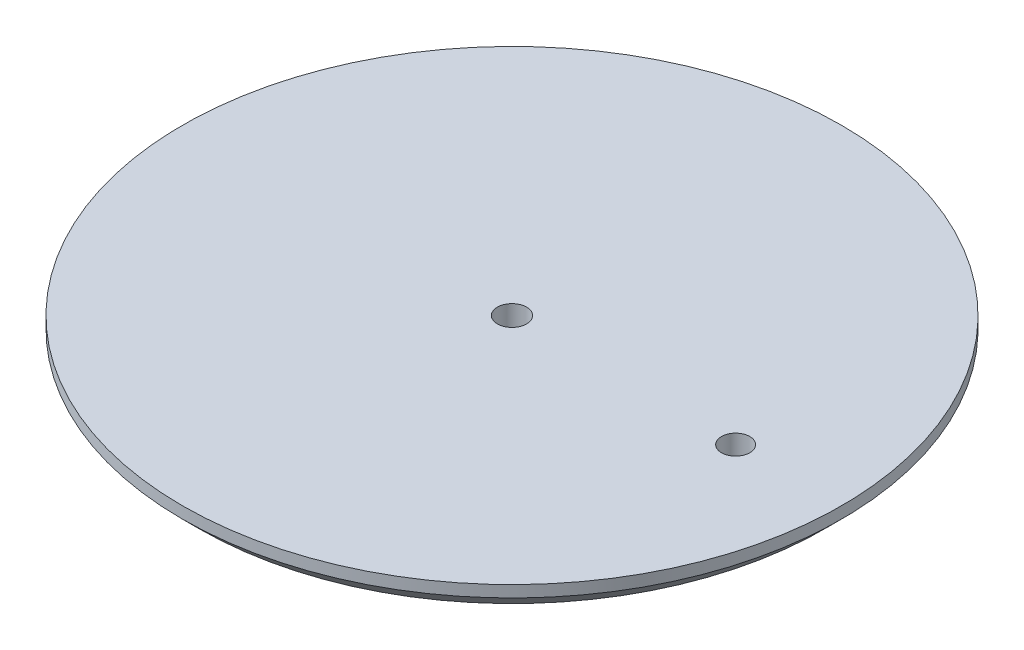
ISO-10303-21;
HEADER;
FILE_DESCRIPTION(('STEP AP214'),'2;1');
FILE_NAME('part.step','',(''),(''),'','','');
FILE_SCHEMA(('AUTOMOTIVE_DESIGN { 1 0 10303 214 1 1 1 1 }'));
ENDSEC;
DATA;
#1=APPLICATION_CONTEXT('core data for automotive mechanical design processes');
#2=APPLICATION_PROTOCOL_DEFINITION('international standard','automotive_design',2000,#1);
#3=PRODUCT_CONTEXT('',#1,'mechanical');
#4=PRODUCT('Part','Part','',(#3));
#5=PRODUCT_RELATED_PRODUCT_CATEGORY('part','',(#4));
#6=PRODUCT_DEFINITION_FORMATION('','',#4);
#7=PRODUCT_DEFINITION_CONTEXT('part definition',#1,'design');
#8=PRODUCT_DEFINITION('design','',#6,#7);
#9=PRODUCT_DEFINITION_SHAPE('','',#8);
#10=(LENGTH_UNIT() NAMED_UNIT(*) SI_UNIT(.MILLI.,.METRE.));
#11=(NAMED_UNIT(*) PLANE_ANGLE_UNIT() SI_UNIT($,.RADIAN.));
#12=(NAMED_UNIT(*) SI_UNIT($,.STERADIAN.) SOLID_ANGLE_UNIT());
#13=UNCERTAINTY_MEASURE_WITH_UNIT(LENGTH_MEASURE(1.E-05),#10,'distance_accuracy_value','');
#14=(GEOMETRIC_REPRESENTATION_CONTEXT(3) GLOBAL_UNCERTAINTY_ASSIGNED_CONTEXT((#13)) GLOBAL_UNIT_ASSIGNED_CONTEXT((#10,
#11,#12)) REPRESENTATION_CONTEXT('',''));
#15=CARTESIAN_POINT('',(0.,0.,0.));
#16=DIRECTION('',(0.,0.,1.));
#17=DIRECTION('',(1.,0.,0.));
#18=AXIS2_PLACEMENT_3D('',#15,#16,#17);
#19=CARTESIAN_POINT('',(66.4644660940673,0.,0.));
#20=DIRECTION('',(0.,1.,0.));
#21=DIRECTION('',(0.,0.,1.));
#22=AXIS2_PLACEMENT_3D('',#19,#20,#21);
#23=PLANE('',#22);
#24=CARTESIAN_POINT('',(47.5,0.,0.));
#25=DIRECTION('',(0.,1.,0.));
#26=DIRECTION('',(0.,0.,1.));
#27=AXIS2_PLACEMENT_3D('',#24,#25,#26);
#28=CIRCLE('',#27,3.);
#29=CARTESIAN_POINT('',(47.5,0.,3.));
#30=VERTEX_POINT('',#29);
#31=EDGE_CURVE('E51',#30,#30,#28,.T.);
#32=ORIENTED_EDGE('',*,*,#31,.T.);
#33=EDGE_LOOP('',(#32));
#34=FACE_BOUND('',#33,.T.);
#35=CARTESIAN_POINT('',(0.,0.,0.));
#36=DIRECTION('',(0.,1.,0.));
#37=DIRECTION('',(0.,0.,1.));
#38=AXIS2_PLACEMENT_3D('',#35,#36,#37);
#39=CIRCLE('',#38,3.1);
#40=CARTESIAN_POINT('',(0.,0.,3.1));
#41=VERTEX_POINT('',#40);
#42=EDGE_CURVE('E43',#41,#41,#39,.T.);
#43=ORIENTED_EDGE('',*,*,#42,.T.);
#44=EDGE_LOOP('',(#43));
#45=FACE_BOUND('',#44,.T.);
#46=CARTESIAN_POINT('',(0.,0.,0.));
#47=DIRECTION('',(0.,1.,0.));
#48=DIRECTION('',(0.,0.,1.));
#49=AXIS2_PLACEMENT_3D('',#46,#47,#48);
#50=CIRCLE('',#49,66.4644660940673);
#51=CARTESIAN_POINT('',(0.,0.,66.4644660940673));
#52=VERTEX_POINT('',#51);
#53=EDGE_CURVE('E10',#52,#52,#50,.T.);
#54=ORIENTED_EDGE('',*,*,#53,.F.);
#55=EDGE_LOOP('',(#54));
#56=FACE_BOUND('',#55,.T.);
#57=ADVANCED_FACE('F29',(#34,#45,#56),#23,.F.);
#58=CARTESIAN_POINT('',(0.,0.,0.));
#59=DIRECTION('',(0.,1.,0.));
#60=DIRECTION('',(0.,0.,1.));
#61=AXIS2_PLACEMENT_3D('',#58,#59,#60);
#62=CONICAL_SURFACE('',#61,66.4644660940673,0.785398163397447);
#63=CARTESIAN_POINT('',(0.,3.53553390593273,0.));
#64=DIRECTION('',(0.,1.,0.));
#65=DIRECTION('',(0.,0.,1.));
#66=AXIS2_PLACEMENT_3D('',#63,#64,#65);
#67=CIRCLE('',#66,70.);
#68=CARTESIAN_POINT('',(0.,3.53553390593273,70.));
#69=VERTEX_POINT('',#68);
#70=EDGE_CURVE('E35',#69,#69,#67,.T.);
#71=ORIENTED_EDGE('',*,*,#70,.F.);
#72=EDGE_LOOP('',(#71));
#73=FACE_BOUND('',#72,.T.);
#74=ORIENTED_EDGE('',*,*,#53,.T.);
#75=EDGE_LOOP('',(#74));
#76=FACE_BOUND('',#75,.T.);
#77=ADVANCED_FACE('F71',(#73,#76),#62,.T.);
#78=CARTESIAN_POINT('',(0.,18.0759168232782,0.));
#79=DIRECTION('',(0.,1.,0.));
#80=DIRECTION('',(0.,0.,1.));
#81=AXIS2_PLACEMENT_3D('',#78,#79,#80);
#82=CYLINDRICAL_SURFACE('',#81,70.);
#83=CARTESIAN_POINT('',(0.,6.,0.));
#84=DIRECTION('',(0.,1.,0.));
#85=DIRECTION('',(0.,0.,1.));
#86=AXIS2_PLACEMENT_3D('',#83,#84,#85);
#87=CIRCLE('',#86,70.);
#88=CARTESIAN_POINT('',(0.,6.,70.));
#89=VERTEX_POINT('',#88);
#90=EDGE_CURVE('E39',#89,#89,#87,.T.);
#91=ORIENTED_EDGE('',*,*,#90,.F.);
#92=EDGE_LOOP('',(#91));
#93=FACE_BOUND('',#92,.T.);
#94=ORIENTED_EDGE('',*,*,#70,.T.);
#95=EDGE_LOOP('',(#94));
#96=FACE_BOUND('',#95,.T.);
#97=ADVANCED_FACE('F64',(#93,#96),#82,.T.);
#98=CARTESIAN_POINT('',(35.,5.99999999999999,0.));
#99=DIRECTION('',(0.,-1.,0.));
#100=DIRECTION('',(0.,0.,-1.));
#101=AXIS2_PLACEMENT_3D('',#98,#99,#100);
#102=PLANE('',#101);
#103=CARTESIAN_POINT('',(47.5,5.99999999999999,0.));
#104=DIRECTION('',(0.,1.,0.));
#105=DIRECTION('',(0.,0.,1.));
#106=AXIS2_PLACEMENT_3D('',#103,#104,#105);
#107=CIRCLE('',#106,3.);
#108=CARTESIAN_POINT('',(47.5,5.99999999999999,3.));
#109=VERTEX_POINT('',#108);
#110=EDGE_CURVE('E54',#109,#109,#107,.T.);
#111=ORIENTED_EDGE('',*,*,#110,.F.);
#112=EDGE_LOOP('',(#111));
#113=FACE_BOUND('',#112,.T.);
#114=CARTESIAN_POINT('',(0.,5.99999999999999,0.));
#115=DIRECTION('',(0.,1.,0.));
#116=DIRECTION('',(0.,0.,1.));
#117=AXIS2_PLACEMENT_3D('',#114,#115,#116);
#118=CIRCLE('',#117,3.1);
#119=CARTESIAN_POINT('',(0.,5.99999999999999,3.1));
#120=VERTEX_POINT('',#119);
#121=EDGE_CURVE('E48',#120,#120,#118,.T.);
#122=ORIENTED_EDGE('',*,*,#121,.F.);
#123=EDGE_LOOP('',(#122));
#124=FACE_BOUND('',#123,.T.);
#125=ORIENTED_EDGE('',*,*,#90,.T.);
#126=EDGE_LOOP('',(#125));
#127=FACE_BOUND('',#126,.T.);
#128=ADVANCED_FACE('F60',(#113,#124,#127),#102,.F.);
#129=CARTESIAN_POINT('',(0.,0.,0.));
#130=DIRECTION('',(0.,1.,0.));
#131=DIRECTION('',(0.,0.,1.));
#132=AXIS2_PLACEMENT_3D('',#129,#130,#131);
#133=CYLINDRICAL_SURFACE('',#132,3.1);
#134=ORIENTED_EDGE('',*,*,#42,.F.);
#135=EDGE_LOOP('',(#134));
#136=FACE_BOUND('',#135,.T.);
#137=ORIENTED_EDGE('',*,*,#121,.T.);
#138=EDGE_LOOP('',(#137));
#139=FACE_BOUND('',#138,.T.);
#140=ADVANCED_FACE('F63',(#136,#139),#133,.F.);
#141=CARTESIAN_POINT('',(47.5,0.,0.));
#142=DIRECTION('',(0.,1.,0.));
#143=DIRECTION('',(0.,0.,1.));
#144=AXIS2_PLACEMENT_3D('',#141,#142,#143);
#145=CYLINDRICAL_SURFACE('',#144,3.);
#146=ORIENTED_EDGE('',*,*,#31,.F.);
#147=EDGE_LOOP('',(#146));
#148=FACE_BOUND('',#147,.T.);
#149=ORIENTED_EDGE('',*,*,#110,.T.);
#150=EDGE_LOOP('',(#149));
#151=FACE_BOUND('',#150,.T.);
#152=ADVANCED_FACE('F58',(#148,#151),#145,.F.);
#153=CLOSED_SHELL('',(#57,#77,#97,#128,#140,#152));
#154=MANIFOLD_SOLID_BREP('B2',#153);
#155=ADVANCED_BREP_SHAPE_REPRESENTATION('',(#18,#154),#14);
#156=SHAPE_DEFINITION_REPRESENTATION(#9,#155);
ENDSEC;
END-ISO-10303-21;
